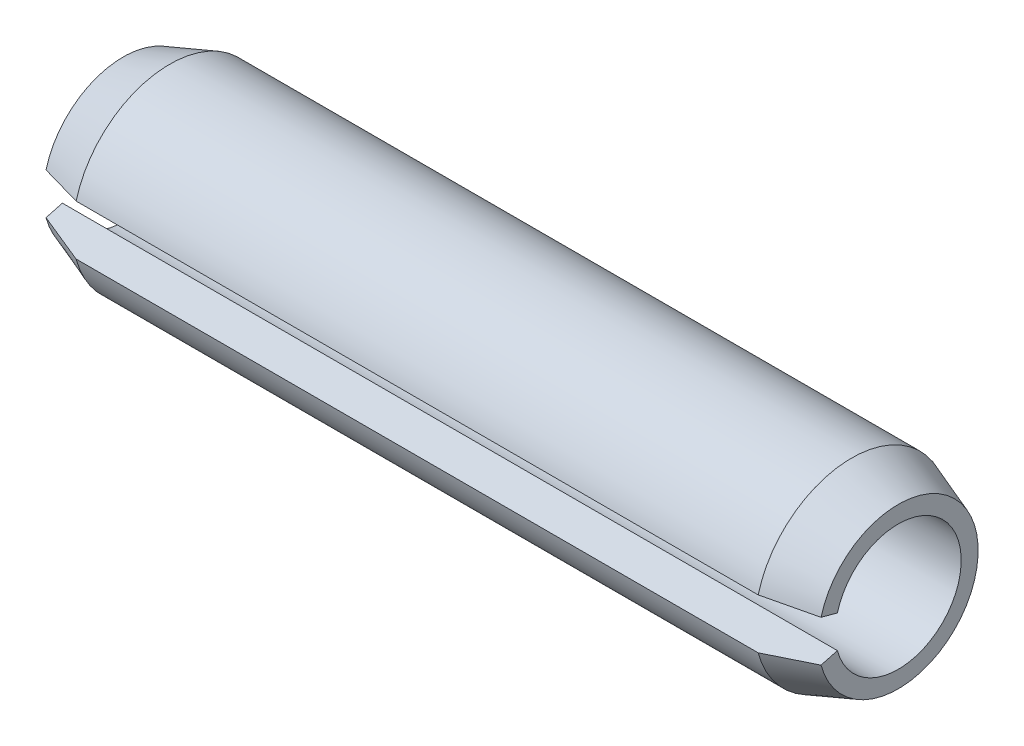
from build123d import *

# Parameters (mm, degrees)
SLIT_DEPTH = 41.620192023


with BuildPart() as part:
    # BodySke → BaseBody (revolve)
    with BuildSketch(Plane(origin=(0, 0, 0), x_dir=(1, 0, 0), z_dir=(0, 1, 0)), mode=Mode.PRIVATE) as basebody_sk:
        Polygon((0, 3.25), (40, 3.25), (40, 4.125), (37.6, 5), (2.4, 5), (0, 4.125), align=None)
    revolve(basebody_sk.sketch.rotate(Axis((0, 0, 0), (1, 0, 0)), 180), axis=Axis((0, 0, 0), (1, 0, 0)))

    # SlitSke → Slit (cut, through all)
    with BuildSketch(Plane(origin=(0, 0, 0), x_dir=(0, 0, -1), z_dir=(1, 0, 0))):
        with BuildLine():
            Line((0, 0), (-4.829629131, 1.294095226))
            ThreePointArc((-4.829629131, 1.294095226), (-5, 0), (-4.829629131, -1.294095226))
            Line((-4.829629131, -1.294095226), (0, 0))
        make_face()
    extrude(amount=SLIT_DEPTH, mode=Mode.SUBTRACT)


solid = part.part
